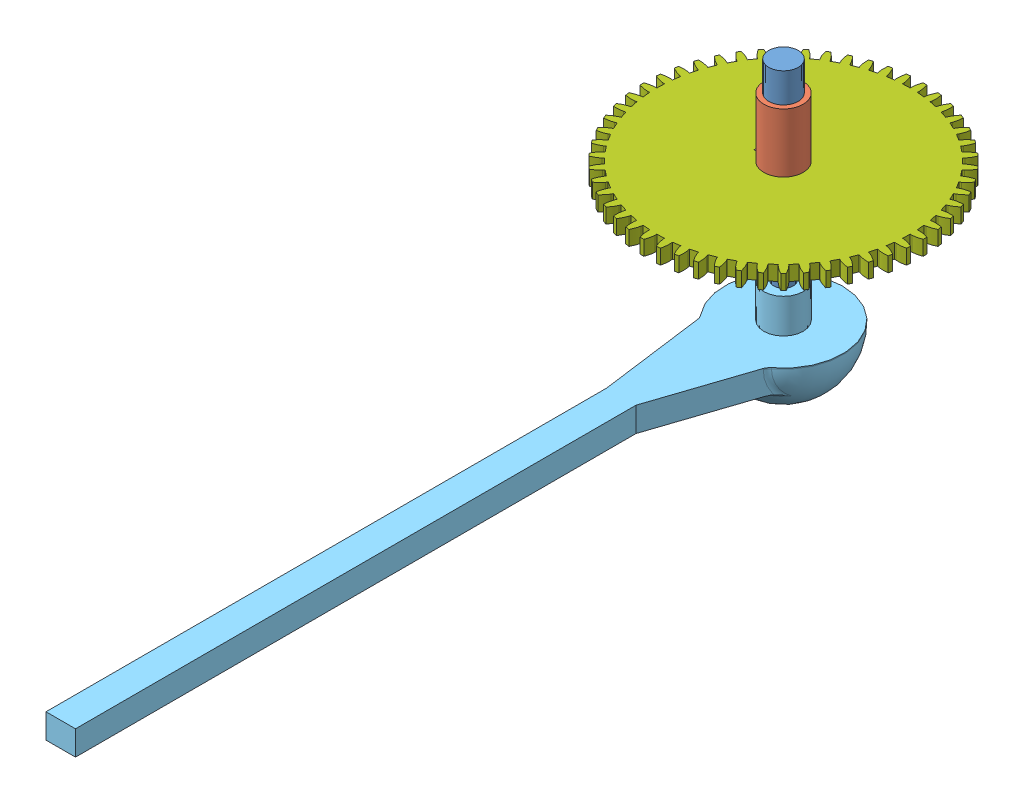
SolidWorks assembly Axle Assembly G.SLDASM, configuration Default (file format 6000). Lengths in mm.
Overall size (28 29.1 86).
8 component instances, 7 part files, 21 mates.
Components (placement in the parent):
- Axle G-1: Axle G.SLDPRT [Default] at (-25.1043 5.0002 1.9251) size (3 23 3)
- Spacer 6mm-1: Spacer 6mm.SLDPRT [Default] at (-23.6043 18.5002 1.9251) x (0 0 1) z (1 0 0) size (4 6 4)
- Spacer 1.5mm-1: Spacer 1.5mm.SLDPRT [Default] at (-23.6043 8.0002 1.9251) x (0 0 1) z (-1 0 0) size (4 1.5 4)
- Key-1: Key.SLDPRT [Default] at (-25.1043 12.5002 1.9251) x (1 0 0) z (0 0 -1) size (2 1.5 1)
- Key-2: Key.SLDPRT [Default] at (-25.1043 9.5002 1.9251) x (-1 0 0) z (0 0 -1) size (2 1.5 1)
- Pointer Back Large Inner-1: Pointer Back Large Inner.SLDPRT [Default] at (-23.6043 2.0002 1.9251) x (-1 0 0) z (0 0 1) size (12 9.6 78)
- Gear 20T-1: Gear 20T.sldprt [Default] at (-23.6043 11.0002 1.9251) x (0 0 1) z (1 0 0) size (10.99 1.5 10.99)
- Gear 54T-1: Gear 54T.sldprt [Default] at (-23.6043 12.5002 1.9251) x (0 0 1) z (1 0 0) size (28 1.5 28)
Mates (geometry in assembly coordinates):
- Coincident1: coincident anti-aligned: plane of Key-1 through (-25.1043 11.0002 1.9251) normal (0 -1 0); plane of Key-2 through (-25.1043 11.0002 1.9251) normal (0 1 0)
- Coincident2: coincident aligned: plane of Key-1 through (-26.1043 11.0002 1.4251) normal (0 0 -1); plane of Key-2 through (-24.1043 11.0002 1.4251) normal (0 0 -1)
- Coincident3: coincident aligned: plane of Key-1 through (-24.1043 11.0002 1.4251) normal (1 0 0); plane of Key-2 through (-24.1043 11.0002 1.4251) normal (1 0 0)
- Coincident4: coincident anti-aligned: plane of Axle G-1 through (-24.1043 5.0002 1.9251) normal (-1 0 0); plane of Key-2 through (-24.1043 11.0002 1.4251) normal (1 0 0)
- Coincident5: coincident anti-aligned: plane of Axle G-1 through (-24.1043 9.5002 2.4251) normal (0 0 -1); plane of Key-2 through (-24.1043 11.0002 2.4251) normal (0 0 1)
- Coincident6: coincident anti-aligned: plane of Axle G-1 through (-24.1043 9.5002 1.4251) normal (0 1 0); plane of Key-2 through (-25.1043 9.5002 1.9251) normal (0 -1 0)
- Concentric3: concentric anti-aligned: cylinder of Axle G-1 through (-23.6043 21.5002 1.9251) axis (0 -1 0) radius 1.5; cylinder of Spacer 6mm-1 through (-23.6043 12.5002 1.9251) axis (0 1 0) radius 1.5
- Concentric4: concentric aligned: cylinder of Axle G-1 through (-23.6043 21.5002 1.9251) axis (0 -1 0) radius 1.5; cylinder of Spacer 1.5mm-1 through (-23.6043 9.5002 1.9251) axis (0 -1 0) radius 1.5
- Coincident16: coincident anti-aligned: plane of Spacer 1.5mm-1 through (-23.6043 9.5002 1.9251) normal (0 1 0); plane of Key-2 through (-25.1043 9.5002 1.9251) normal (0 -1 0)
- Coincident17: coincident anti-aligned: plane of Spacer 6mm-1 through (-23.6043 12.5002 1.9251) normal (0 -1 0); plane of Key-1 through (-25.1043 12.5002 1.9251) normal (0 1 0)
- Parallel6: parallel anti-aligned: line of Spacer 6mm-1 through (-23.6043 18.5002 1.9251) axis (1 0 0); line of Spacer 1.5mm-1 through (-23.6043 8.0002 1.9251) axis (-1 0 0)
- Parallel7: parallel anti-aligned: line of Spacer 1.5mm-1 through (-23.6043 8.0002 1.9251) axis (-1 0 0); line of Key-1 through (-26.1043 11.0002 1.4251) axis (1 0 0)
- Coincident18: coincident aligned: plane of Key-2 through (-25.1043 9.5002 1.9251) normal (0 -1 0); plane of Gear 20T-1 through (-22.1955 9.5002 -4.5581) normal (0 -1 0)
- Concentric6: concentric anti-aligned: cylinder of Axle G-1 through (-23.6043 21.5002 1.9251) axis (0 -1 0) radius 1.5; cylinder of Gear 20T-1 through (-23.6043 9.5002 1.9251) axis (0 1 0) radius 1.5
- Parallel8: parallel anti-aligned: line of Key-2 through (-26.1043 9.5002 1.4251) axis (0 0 1); line of Gear 20T-1 through (-26.1043 9.5002 2.4251) axis (0 0 -1)
- Coincident20: coincident aligned: plane of Key-1 through (-25.1043 12.5002 1.9251) normal (0 1 0); plane of Gear 54T-1 through (-18.6264 12.5002 -16.9478) normal (0 1 0)
- Concentric7: concentric anti-aligned: cylinder of Axle G-1 through (-23.6043 21.5002 1.9251) axis (0 -1 0) radius 1.5; cylinder of Gear 54T-1 through (-23.6043 11.0002 1.9251) axis (0 1 0) radius 1.5
- Parallel9: parallel aligned: line of Key-1 through (-26.1043 12.5002 2.4251) axis (0 0 -1); line of Gear 54T-1 through (-26.1043 12.5002 2.4251) axis (0 0 -1)
- Concentric8: concentric aligned: cylinder of Axle G-1 through (-23.6043 -1.4998 1.9251) axis (0 1 0) radius 1; cylinder of Pointer Back Large Inner-1 through (-23.6043 -1.4998 1.9251) axis (0 1 0) radius 2
- Parallel10: parallel aligned: plane of Axle G-1 through (-24.3114 2.0002 1.9251) normal (-1 0 0); plane of Pointer Back Large Inner-1 through (-22.8972 -1.4998 1.218) normal (-1 0 0)
- Coincident23: coincident anti-aligned: plane of Axle G-1 through (-23.6043 -1.4998 1.9251) normal (0 -1 0); plane of Pointer Back Large Inner-1 through (-23.6043 -1.4998 1.9251) normal (0 1 0)
